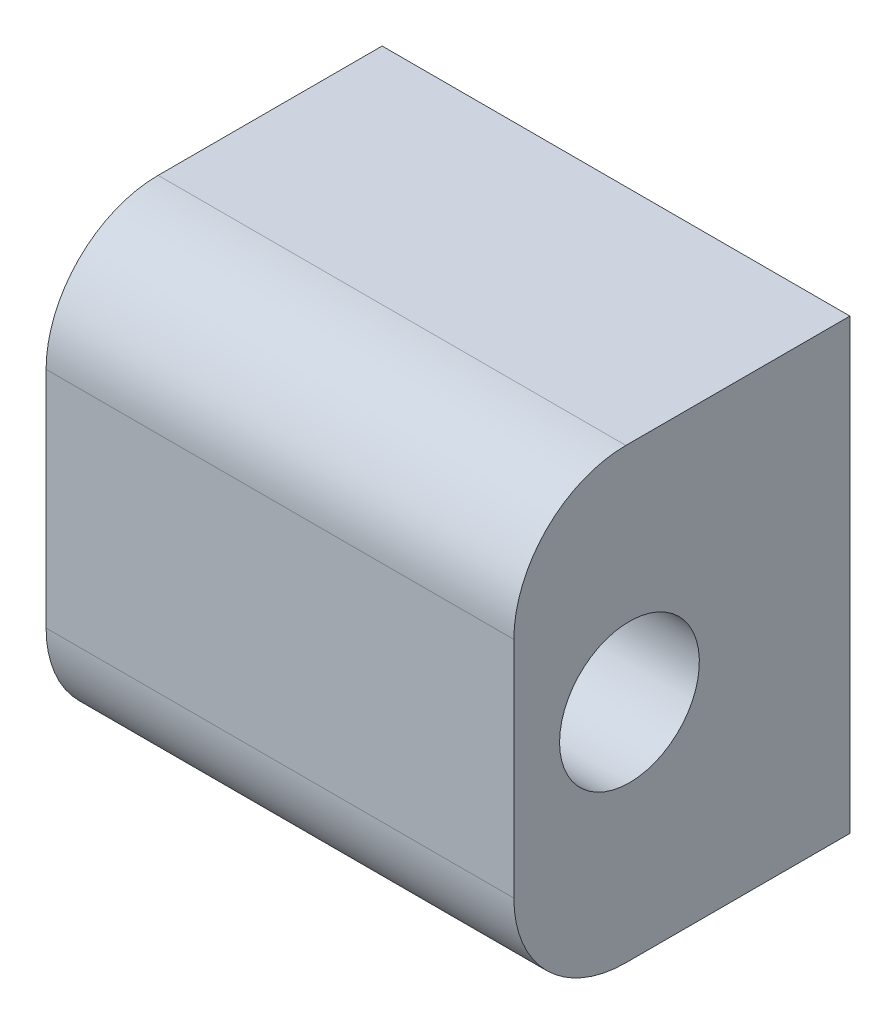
ISO-10303-21;
HEADER;
FILE_DESCRIPTION(('STEP AP214'),'2;1');
FILE_NAME('part.step','',(''),(''),'','','');
FILE_SCHEMA(('AUTOMOTIVE_DESIGN { 1 0 10303 214 1 1 1 1 }'));
ENDSEC;
DATA;
#1=APPLICATION_CONTEXT('core data for automotive mechanical design processes');
#2=APPLICATION_PROTOCOL_DEFINITION('international standard','automotive_design',2000,#1);
#3=PRODUCT_CONTEXT('',#1,'mechanical');
#4=PRODUCT('Part','Part','',(#3));
#5=PRODUCT_RELATED_PRODUCT_CATEGORY('part','',(#4));
#6=PRODUCT_DEFINITION_FORMATION('','',#4);
#7=PRODUCT_DEFINITION_CONTEXT('part definition',#1,'design');
#8=PRODUCT_DEFINITION('design','',#6,#7);
#9=PRODUCT_DEFINITION_SHAPE('','',#8);
#10=(LENGTH_UNIT() NAMED_UNIT(*) SI_UNIT(.MILLI.,.METRE.));
#11=(NAMED_UNIT(*) PLANE_ANGLE_UNIT() SI_UNIT($,.RADIAN.));
#12=(NAMED_UNIT(*) SI_UNIT($,.STERADIAN.) SOLID_ANGLE_UNIT());
#13=UNCERTAINTY_MEASURE_WITH_UNIT(LENGTH_MEASURE(1.E-05),#10,'distance_accuracy_value','');
#14=(GEOMETRIC_REPRESENTATION_CONTEXT(3) GLOBAL_UNCERTAINTY_ASSIGNED_CONTEXT((#13)) GLOBAL_UNIT_ASSIGNED_CONTEXT((#10,
#11,#12)) REPRESENTATION_CONTEXT('',''));
#15=CARTESIAN_POINT('',(0.,0.,0.));
#16=DIRECTION('',(0.,0.,1.));
#17=DIRECTION('',(1.,0.,0.));
#18=AXIS2_PLACEMENT_3D('',#15,#16,#17);
#19=CARTESIAN_POINT('',(0.,0.,0.));
#20=DIRECTION('',(0.,0.,1.));
#21=DIRECTION('',(1.,0.,0.));
#22=AXIS2_PLACEMENT_3D('',#19,#20,#21);
#23=PLANE('',#22);
#24=CARTESIAN_POINT('',(-7.1374,7.5438,0.));
#25=DIRECTION('',(0.,0.,1.));
#26=DIRECTION('',(1.,0.,0.));
#27=AXIS2_PLACEMENT_3D('',#24,#25,#26);
#28=CIRCLE('',#27,3.175);
#29=CARTESIAN_POINT('',(-3.9624,7.5438,0.));
#30=VERTEX_POINT('',#29);
#31=EDGE_CURVE('E233',#30,#30,#28,.T.);
#32=ORIENTED_EDGE('',*,*,#31,.T.);
#33=EDGE_LOOP('',(#32));
#34=FACE_BOUND('',#33,.T.);
#35=CARTESIAN_POINT('',(-7.1374,-7.5438,0.));
#36=DIRECTION('',(0.,0.,1.));
#37=DIRECTION('',(1.,0.,0.));
#38=AXIS2_PLACEMENT_3D('',#35,#36,#37);
#39=CIRCLE('',#38,3.175);
#40=CARTESIAN_POINT('',(-3.9624,-7.5438,0.));
#41=VERTEX_POINT('',#40);
#42=EDGE_CURVE('E227',#41,#41,#39,.T.);
#43=ORIENTED_EDGE('',*,*,#42,.T.);
#44=EDGE_LOOP('',(#43));
#45=FACE_BOUND('',#44,.T.);
#46=DIRECTION('',(1.,0.,0.));
#47=VECTOR('',#46,1.);
#48=CARTESIAN_POINT('',(-13.2588,-12.7,0.));
#49=LINE('',#48,#47);
#50=CARTESIAN_POINT('',(-13.2588,-12.7,0.));
#51=VERTEX_POINT('',#50);
#52=CARTESIAN_POINT('',(13.2588,-12.7,0.));
#53=VERTEX_POINT('',#52);
#54=EDGE_CURVE('E91',#51,#53,#49,.T.);
#55=ORIENTED_EDGE('',*,*,#54,.F.);
#56=DIRECTION('',(0.,-1.,0.));
#57=VECTOR('',#56,1.);
#58=CARTESIAN_POINT('',(-13.2588,12.7,0.));
#59=LINE('',#58,#57);
#60=CARTESIAN_POINT('',(-13.2588,12.7,0.));
#61=VERTEX_POINT('',#60);
#62=EDGE_CURVE('E100',#61,#51,#59,.T.);
#63=ORIENTED_EDGE('',*,*,#62,.F.);
#64=DIRECTION('',(-1.,0.,0.));
#65=VECTOR('',#64,1.);
#66=CARTESIAN_POINT('',(13.2588,12.7,0.));
#67=LINE('',#66,#65);
#68=CARTESIAN_POINT('',(13.2588,12.7,0.));
#69=VERTEX_POINT('',#68);
#70=EDGE_CURVE('E108',#69,#61,#67,.T.);
#71=ORIENTED_EDGE('',*,*,#70,.F.);
#72=DIRECTION('',(0.,1.,0.));
#73=VECTOR('',#72,1.);
#74=CARTESIAN_POINT('',(13.2588,0.,0.));
#75=LINE('',#74,#73);
#76=EDGE_CURVE('E113',#53,#69,#75,.T.);
#77=ORIENTED_EDGE('',*,*,#76,.F.);
#78=EDGE_LOOP('',(#55,#63,#71,#77));
#79=FACE_BOUND('',#78,.T.);
#80=CARTESIAN_POINT('',(7.1374,-7.5438,0.));
#81=DIRECTION('',(0.,0.,1.));
#82=DIRECTION('',(1.,0.,0.));
#83=AXIS2_PLACEMENT_3D('',#80,#81,#82);
#84=CIRCLE('',#83,3.175);
#85=CARTESIAN_POINT('',(10.3124,-7.5438,0.));
#86=VERTEX_POINT('',#85);
#87=EDGE_CURVE('E228',#86,#86,#84,.T.);
#88=ORIENTED_EDGE('',*,*,#87,.T.);
#89=EDGE_LOOP('',(#88));
#90=FACE_BOUND('',#89,.T.);
#91=CARTESIAN_POINT('',(7.1374,7.5438,0.));
#92=DIRECTION('',(0.,0.,1.));
#93=DIRECTION('',(1.,0.,0.));
#94=AXIS2_PLACEMENT_3D('',#91,#92,#93);
#95=CIRCLE('',#94,3.175);
#96=CARTESIAN_POINT('',(10.3124,7.5438,0.));
#97=VERTEX_POINT('',#96);
#98=EDGE_CURVE('E401',#97,#97,#95,.T.);
#99=ORIENTED_EDGE('',*,*,#98,.T.);
#100=EDGE_LOOP('',(#99));
#101=FACE_BOUND('',#100,.T.);
#102=ADVANCED_FACE('F33',(#34,#45,#79,#90,#101),#23,.F.);
#103=CARTESIAN_POINT('',(-13.2588,-12.7,19.05));
#104=DIRECTION('',(0.,1.,0.));
#105=DIRECTION('',(0.,0.,1.));
#106=AXIS2_PLACEMENT_3D('',#103,#104,#105);
#107=PLANE('',#106);
#108=DIRECTION('',(0.,0.,-1.));
#109=VECTOR('',#108,1.);
#110=CARTESIAN_POINT('',(13.2588,-12.7,19.05));
#111=LINE('',#110,#109);
#112=CARTESIAN_POINT('',(13.2588,-12.7,12.7));
#113=VERTEX_POINT('',#112);
#114=EDGE_CURVE('E97',#113,#53,#111,.T.);
#115=ORIENTED_EDGE('',*,*,#114,.F.);
#116=DIRECTION('',(1.,0.,0.));
#117=VECTOR('',#116,1.);
#118=CARTESIAN_POINT('',(-13.2588,-12.7,12.7));
#119=LINE('',#118,#117);
#120=CARTESIAN_POINT('',(-13.2588,-12.7,12.7));
#121=VERTEX_POINT('',#120);
#122=EDGE_CURVE('E93',#113,#121,#119,.F.);
#123=ORIENTED_EDGE('',*,*,#122,.T.);
#124=DIRECTION('',(0.,0.,-1.));
#125=VECTOR('',#124,1.);
#126=CARTESIAN_POINT('',(-13.2588,-12.7,19.05));
#127=LINE('',#126,#125);
#128=EDGE_CURVE('E87',#121,#51,#127,.T.);
#129=ORIENTED_EDGE('',*,*,#128,.T.);
#130=ORIENTED_EDGE('',*,*,#54,.T.);
#131=EDGE_LOOP('',(#115,#123,#129,#130));
#132=FACE_BOUND('',#131,.T.);
#133=ADVANCED_FACE('F89',(#132),#107,.F.);
#134=CARTESIAN_POINT('',(13.2588,0.,19.05));
#135=DIRECTION('',(-1.,0.,0.));
#136=DIRECTION('',(0.,0.,1.));
#137=AXIS2_PLACEMENT_3D('',#134,#135,#136);
#138=PLANE('',#137);
#139=CARTESIAN_POINT('',(13.2588,0.,12.4968));
#140=DIRECTION('',(-1.,0.,0.));
#141=DIRECTION('',(0.,0.,1.));
#142=AXIS2_PLACEMENT_3D('',#139,#140,#141);
#143=CIRCLE('',#142,3.9624);
#144=CARTESIAN_POINT('',(13.2588,0.,16.4592));
#145=VERTEX_POINT('',#144);
#146=EDGE_CURVE('E114',#145,#145,#143,.T.);
#147=ORIENTED_EDGE('',*,*,#146,.T.);
#148=EDGE_LOOP('',(#147));
#149=FACE_BOUND('',#148,.T.);
#150=DIRECTION('',(0.,0.,-1.));
#151=VECTOR('',#150,1.);
#152=CARTESIAN_POINT('',(13.2588,12.7,19.05));
#153=LINE('',#152,#151);
#154=CARTESIAN_POINT('',(13.2588,12.7,12.7));
#155=VERTEX_POINT('',#154);
#156=EDGE_CURVE('E126',#155,#69,#153,.T.);
#157=ORIENTED_EDGE('',*,*,#156,.F.);
#158=CARTESIAN_POINT('',(13.2588,6.35,12.7));
#159=DIRECTION('',(-1.,0.,0.));
#160=DIRECTION('',(0.,0.,1.));
#161=AXIS2_PLACEMENT_3D('',#158,#159,#160);
#162=CIRCLE('',#161,6.35);
#163=CARTESIAN_POINT('',(13.2588,6.35,19.05));
#164=VERTEX_POINT('',#163);
#165=EDGE_CURVE('E140',#155,#164,#162,.F.);
#166=ORIENTED_EDGE('',*,*,#165,.T.);
#167=DIRECTION('',(0.,1.,0.));
#168=VECTOR('',#167,1.);
#169=CARTESIAN_POINT('',(13.2588,-12.7,19.05));
#170=LINE('',#169,#168);
#171=CARTESIAN_POINT('',(13.2588,-6.35,19.05));
#172=VERTEX_POINT('',#171);
#173=EDGE_CURVE('E121',#172,#164,#170,.T.);
#174=ORIENTED_EDGE('',*,*,#173,.F.);
#175=CARTESIAN_POINT('',(13.2588,-6.35,12.7));
#176=DIRECTION('',(-1.,0.,0.));
#177=DIRECTION('',(0.,0.,1.));
#178=AXIS2_PLACEMENT_3D('',#175,#176,#177);
#179=CIRCLE('',#178,6.35);
#180=EDGE_CURVE('E48',#172,#113,#179,.F.);
#181=ORIENTED_EDGE('',*,*,#180,.T.);
#182=ORIENTED_EDGE('',*,*,#114,.T.);
#183=ORIENTED_EDGE('',*,*,#76,.T.);
#184=EDGE_LOOP('',(#157,#166,#174,#181,#182,#183));
#185=FACE_BOUND('',#184,.T.);
#186=ADVANCED_FACE('F181',(#149,#185),#138,.F.);
#187=CARTESIAN_POINT('',(13.2588,12.7,19.05));
#188=DIRECTION('',(0.,-1.,0.));
#189=DIRECTION('',(1.,0.,0.));
#190=AXIS2_PLACEMENT_3D('',#187,#188,#189);
#191=PLANE('',#190);
#192=DIRECTION('',(0.,0.,-1.));
#193=VECTOR('',#192,1.);
#194=CARTESIAN_POINT('',(-13.2588,12.7,19.05));
#195=LINE('',#194,#193);
#196=CARTESIAN_POINT('',(-13.2588,12.7,12.7));
#197=VERTEX_POINT('',#196);
#198=EDGE_CURVE('E103',#197,#61,#195,.T.);
#199=ORIENTED_EDGE('',*,*,#198,.F.);
#200=DIRECTION('',(-1.,0.,0.));
#201=VECTOR('',#200,1.);
#202=CARTESIAN_POINT('',(13.2588,12.7,12.7));
#203=LINE('',#202,#201);
#204=EDGE_CURVE('E56',#197,#155,#203,.F.);
#205=ORIENTED_EDGE('',*,*,#204,.T.);
#206=ORIENTED_EDGE('',*,*,#156,.T.);
#207=ORIENTED_EDGE('',*,*,#70,.T.);
#208=EDGE_LOOP('',(#199,#205,#206,#207));
#209=FACE_BOUND('',#208,.T.);
#210=ADVANCED_FACE('F191',(#209),#191,.F.);
#211=CARTESIAN_POINT('',(-13.2588,12.7,19.05));
#212=DIRECTION('',(1.,0.,0.));
#213=DIRECTION('',(0.,1.,0.));
#214=AXIS2_PLACEMENT_3D('',#211,#212,#213);
#215=PLANE('',#214);
#216=CARTESIAN_POINT('',(-13.2588,0.,12.4968));
#217=DIRECTION('',(-1.,0.,0.));
#218=DIRECTION('',(0.,-1.,0.));
#219=AXIS2_PLACEMENT_3D('',#216,#217,#218);
#220=CIRCLE('',#219,3.9624);
#221=CARTESIAN_POINT('',(-13.2588,-3.9624,12.4968));
#222=VERTEX_POINT('',#221);
#223=EDGE_CURVE('E118',#222,#222,#220,.T.);
#224=ORIENTED_EDGE('',*,*,#223,.F.);
#225=EDGE_LOOP('',(#224));
#226=FACE_BOUND('',#225,.T.);
#227=DIRECTION('',(0.,-1.,0.));
#228=VECTOR('',#227,1.);
#229=CARTESIAN_POINT('',(-13.2588,0.,19.05));
#230=LINE('',#229,#228);
#231=CARTESIAN_POINT('',(-13.2588,6.34999999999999,19.05));
#232=VERTEX_POINT('',#231);
#233=CARTESIAN_POINT('',(-13.2588,-6.35,19.05));
#234=VERTEX_POINT('',#233);
#235=EDGE_CURVE('E107',#232,#234,#230,.T.);
#236=ORIENTED_EDGE('',*,*,#235,.F.);
#237=CARTESIAN_POINT('',(-13.2588,6.34999999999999,12.7));
#238=DIRECTION('',(1.,0.,0.));
#239=DIRECTION('',(0.,1.,0.));
#240=AXIS2_PLACEMENT_3D('',#237,#238,#239);
#241=CIRCLE('',#240,6.35);
#242=EDGE_CURVE('E136',#232,#197,#241,.F.);
#243=ORIENTED_EDGE('',*,*,#242,.T.);
#244=ORIENTED_EDGE('',*,*,#198,.T.);
#245=ORIENTED_EDGE('',*,*,#62,.T.);
#246=ORIENTED_EDGE('',*,*,#128,.F.);
#247=CARTESIAN_POINT('',(-13.2588,-6.35,12.7));
#248=DIRECTION('',(1.,0.,0.));
#249=DIRECTION('',(0.,1.,0.));
#250=AXIS2_PLACEMENT_3D('',#247,#248,#249);
#251=CIRCLE('',#250,6.35);
#252=EDGE_CURVE('E134',#121,#234,#251,.F.);
#253=ORIENTED_EDGE('',*,*,#252,.T.);
#254=EDGE_LOOP('',(#236,#243,#244,#245,#246,#253));
#255=FACE_BOUND('',#254,.T.);
#256=ADVANCED_FACE('F102',(#226,#255),#215,.F.);
#257=CARTESIAN_POINT('',(0.,0.,19.05));
#258=DIRECTION('',(0.,0.,1.));
#259=DIRECTION('',(1.,0.,0.));
#260=AXIS2_PLACEMENT_3D('',#257,#258,#259);
#261=PLANE('',#260);
#262=ORIENTED_EDGE('',*,*,#173,.T.);
#263=DIRECTION('',(-1.,0.,0.));
#264=VECTOR('',#263,1.);
#265=CARTESIAN_POINT('',(-13.2588,6.34999999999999,19.05));
#266=LINE('',#265,#264);
#267=EDGE_CURVE('E131',#164,#232,#266,.T.);
#268=ORIENTED_EDGE('',*,*,#267,.T.);
#269=ORIENTED_EDGE('',*,*,#235,.T.);
#270=DIRECTION('',(1.,0.,0.));
#271=VECTOR('',#270,1.);
#272=CARTESIAN_POINT('',(13.2588,-6.35,19.05));
#273=LINE('',#272,#271);
#274=EDGE_CURVE('E96',#234,#172,#273,.T.);
#275=ORIENTED_EDGE('',*,*,#274,.T.);
#276=EDGE_LOOP('',(#262,#268,#269,#275));
#277=FACE_BOUND('',#276,.T.);
#278=ADVANCED_FACE('F187',(#277),#261,.T.);
#279=CARTESIAN_POINT('',(18.4912,0.,12.4968));
#280=DIRECTION('',(-1.,0.,0.));
#281=DIRECTION('',(0.,-1.,0.));
#282=AXIS2_PLACEMENT_3D('',#279,#280,#281);
#283=CYLINDRICAL_SURFACE('',#282,3.9624);
#284=ORIENTED_EDGE('',*,*,#223,.T.);
#285=EDGE_LOOP('',(#284));
#286=FACE_BOUND('',#285,.T.);
#287=ORIENTED_EDGE('',*,*,#146,.F.);
#288=EDGE_LOOP('',(#287));
#289=FACE_BOUND('',#288,.T.);
#290=ADVANCED_FACE('F223',(#286,#289),#283,.F.);
#291=CARTESIAN_POINT('',(-7.1374,-7.5438,17.272));
#292=DIRECTION('',(0.,0.,-1.));
#293=DIRECTION('',(-1.,0.,0.));
#294=AXIS2_PLACEMENT_3D('',#291,#292,#293);
#295=CYLINDRICAL_SURFACE('',#294,3.175);
#296=CARTESIAN_POINT('',(-7.1374,-7.5438,15.494));
#297=DIRECTION('',(0.,0.,1.));
#298=DIRECTION('',(1.,0.,0.));
#299=AXIS2_PLACEMENT_3D('',#296,#297,#298);
#300=CIRCLE('',#299,3.175);
#301=CARTESIAN_POINT('',(-10.3124,-7.5438,15.494));
#302=VERTEX_POINT('',#301);
#303=EDGE_CURVE('E149',#302,#302,#300,.T.);
#304=ORIENTED_EDGE('',*,*,#303,.T.);
#305=EDGE_LOOP('',(#304));
#306=FACE_BOUND('',#305,.T.);
#307=ORIENTED_EDGE('',*,*,#42,.F.);
#308=EDGE_LOOP('',(#307));
#309=FACE_BOUND('',#308,.T.);
#310=ADVANCED_FACE('F219',(#306,#309),#295,.F.);
#311=CARTESIAN_POINT('',(-7.1374,-7.5438,17.272));
#312=DIRECTION('',(0.,0.,1.));
#313=DIRECTION('',(1.,0.,0.));
#314=AXIS2_PLACEMENT_3D('',#311,#312,#313);
#315=PLANE('',#314);
#316=CARTESIAN_POINT('',(-7.1374,-7.5438,17.272));
#317=DIRECTION('',(0.,0.,1.));
#318=DIRECTION('',(1.,0.,0.));
#319=AXIS2_PLACEMENT_3D('',#316,#317,#318);
#320=CIRCLE('',#319,0.215911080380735);
#321=CARTESIAN_POINT('',(-7.35331108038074,-7.5438,17.272));
#322=VERTEX_POINT('',#321);
#323=EDGE_CURVE('E152',#322,#322,#320,.F.);
#324=ORIENTED_EDGE('',*,*,#323,.T.);
#325=EDGE_LOOP('',(#324));
#326=FACE_BOUND('',#325,.T.);
#327=ADVANCED_FACE('F222',(#326),#315,.F.);
#328=CARTESIAN_POINT('',(7.1374,-7.5438,17.272));
#329=DIRECTION('',(0.,0.,-1.));
#330=DIRECTION('',(-1.,0.,0.));
#331=AXIS2_PLACEMENT_3D('',#328,#329,#330);
#332=CYLINDRICAL_SURFACE('',#331,3.175);
#333=CARTESIAN_POINT('',(7.1374,-7.5438,15.494));
#334=DIRECTION('',(0.,0.,1.));
#335=DIRECTION('',(1.,0.,0.));
#336=AXIS2_PLACEMENT_3D('',#333,#334,#335);
#337=CIRCLE('',#336,3.175);
#338=CARTESIAN_POINT('',(3.9624,-7.5438,15.494));
#339=VERTEX_POINT('',#338);
#340=EDGE_CURVE('E143',#339,#339,#337,.T.);
#341=ORIENTED_EDGE('',*,*,#340,.T.);
#342=EDGE_LOOP('',(#341));
#343=FACE_BOUND('',#342,.T.);
#344=ORIENTED_EDGE('',*,*,#87,.F.);
#345=EDGE_LOOP('',(#344));
#346=FACE_BOUND('',#345,.T.);
#347=ADVANCED_FACE('F253',(#343,#346),#332,.F.);
#348=CARTESIAN_POINT('',(7.1374,-7.5438,17.272));
#349=DIRECTION('',(0.,0.,1.));
#350=DIRECTION('',(1.,0.,0.));
#351=AXIS2_PLACEMENT_3D('',#348,#349,#350);
#352=PLANE('',#351);
#353=CARTESIAN_POINT('',(7.1374,-7.5438,17.272));
#354=DIRECTION('',(0.,0.,1.));
#355=DIRECTION('',(1.,0.,0.));
#356=AXIS2_PLACEMENT_3D('',#353,#354,#355);
#357=CIRCLE('',#356,0.215911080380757);
#358=CARTESIAN_POINT('',(6.92148891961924,-7.5438,17.272));
#359=VERTEX_POINT('',#358);
#360=EDGE_CURVE('E146',#359,#359,#357,.F.);
#361=ORIENTED_EDGE('',*,*,#360,.T.);
#362=EDGE_LOOP('',(#361));
#363=FACE_BOUND('',#362,.T.);
#364=ADVANCED_FACE('F257',(#363),#352,.F.);
#365=CARTESIAN_POINT('',(-7.1374,7.5438,17.272));
#366=DIRECTION('',(0.,0.,-1.));
#367=DIRECTION('',(-1.,0.,0.));
#368=AXIS2_PLACEMENT_3D('',#365,#366,#367);
#369=CYLINDRICAL_SURFACE('',#368,3.175);
#370=CARTESIAN_POINT('',(-7.1374,7.5438,15.494));
#371=DIRECTION('',(0.,0.,1.));
#372=DIRECTION('',(1.,0.,0.));
#373=AXIS2_PLACEMENT_3D('',#370,#371,#372);
#374=CIRCLE('',#373,3.175);
#375=CARTESIAN_POINT('',(-10.3124,7.5438,15.494));
#376=VERTEX_POINT('',#375);
#377=EDGE_CURVE('E155',#376,#376,#374,.T.);
#378=ORIENTED_EDGE('',*,*,#377,.T.);
#379=EDGE_LOOP('',(#378));
#380=FACE_BOUND('',#379,.T.);
#381=ORIENTED_EDGE('',*,*,#31,.F.);
#382=EDGE_LOOP('',(#381));
#383=FACE_BOUND('',#382,.T.);
#384=ADVANCED_FACE('F261',(#380,#383),#369,.F.);
#385=CARTESIAN_POINT('',(-7.1374,7.5438,17.272));
#386=DIRECTION('',(0.,0.,1.));
#387=DIRECTION('',(1.,0.,0.));
#388=AXIS2_PLACEMENT_3D('',#385,#386,#387);
#389=PLANE('',#388);
#390=CARTESIAN_POINT('',(-7.1374,7.5438,17.272));
#391=DIRECTION('',(0.,0.,1.));
#392=DIRECTION('',(1.,0.,0.));
#393=AXIS2_PLACEMENT_3D('',#390,#391,#392);
#394=CIRCLE('',#393,0.215911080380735);
#395=CARTESIAN_POINT('',(-7.35331108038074,7.5438,17.272));
#396=VERTEX_POINT('',#395);
#397=EDGE_CURVE('E158',#396,#396,#394,.F.);
#398=ORIENTED_EDGE('',*,*,#397,.T.);
#399=EDGE_LOOP('',(#398));
#400=FACE_BOUND('',#399,.T.);
#401=ADVANCED_FACE('F265',(#400),#389,.F.);
#402=CARTESIAN_POINT('',(7.1374,7.5438,17.272));
#403=DIRECTION('',(0.,0.,-1.));
#404=DIRECTION('',(-1.,0.,0.));
#405=AXIS2_PLACEMENT_3D('',#402,#403,#404);
#406=CYLINDRICAL_SURFACE('',#405,3.175);
#407=CARTESIAN_POINT('',(7.1374,7.5438,15.494));
#408=DIRECTION('',(0.,0.,1.));
#409=DIRECTION('',(1.,0.,0.));
#410=AXIS2_PLACEMENT_3D('',#407,#408,#409);
#411=CIRCLE('',#410,3.175);
#412=CARTESIAN_POINT('',(3.9624,7.5438,15.494));
#413=VERTEX_POINT('',#412);
#414=EDGE_CURVE('E41',#413,#413,#411,.T.);
#415=ORIENTED_EDGE('',*,*,#414,.T.);
#416=EDGE_LOOP('',(#415));
#417=FACE_BOUND('',#416,.T.);
#418=ORIENTED_EDGE('',*,*,#98,.F.);
#419=EDGE_LOOP('',(#418));
#420=FACE_BOUND('',#419,.T.);
#421=ADVANCED_FACE('F163',(#417,#420),#406,.F.);
#422=CARTESIAN_POINT('',(7.1374,7.5438,17.272));
#423=DIRECTION('',(0.,0.,1.));
#424=DIRECTION('',(1.,0.,0.));
#425=AXIS2_PLACEMENT_3D('',#422,#423,#424);
#426=PLANE('',#425);
#427=CARTESIAN_POINT('',(7.1374,7.5438,17.272));
#428=DIRECTION('',(0.,0.,1.));
#429=DIRECTION('',(1.,0.,0.));
#430=AXIS2_PLACEMENT_3D('',#427,#428,#429);
#431=CIRCLE('',#430,0.215911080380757);
#432=CARTESIAN_POINT('',(6.92148891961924,7.5438,17.272));
#433=VERTEX_POINT('',#432);
#434=EDGE_CURVE('E11',#433,#433,#431,.F.);
#435=ORIENTED_EDGE('',*,*,#434,.T.);
#436=EDGE_LOOP('',(#435));
#437=FACE_BOUND('',#436,.T.);
#438=ADVANCED_FACE('F202',(#437),#426,.F.);
#439=CARTESIAN_POINT('',(0.,6.35,12.7));
#440=DIRECTION('',(1.,0.,0.));
#441=DIRECTION('',(0.,1.,0.));
#442=AXIS2_PLACEMENT_3D('',#439,#440,#441);
#443=CYLINDRICAL_SURFACE('',#442,6.35);
#444=ORIENTED_EDGE('',*,*,#165,.F.);
#445=ORIENTED_EDGE('',*,*,#204,.F.);
#446=ORIENTED_EDGE('',*,*,#242,.F.);
#447=ORIENTED_EDGE('',*,*,#267,.F.);
#448=EDGE_LOOP('',(#444,#445,#446,#447));
#449=FACE_BOUND('',#448,.T.);
#450=ADVANCED_FACE('F198',(#449),#443,.T.);
#451=CARTESIAN_POINT('',(0.,-6.35,12.7));
#452=DIRECTION('',(-1.,0.,0.));
#453=DIRECTION('',(0.,0.,1.));
#454=AXIS2_PLACEMENT_3D('',#451,#452,#453);
#455=CYLINDRICAL_SURFACE('',#454,6.35);
#456=ORIENTED_EDGE('',*,*,#252,.F.);
#457=ORIENTED_EDGE('',*,*,#122,.F.);
#458=ORIENTED_EDGE('',*,*,#180,.F.);
#459=ORIENTED_EDGE('',*,*,#274,.F.);
#460=EDGE_LOOP('',(#456,#457,#458,#459));
#461=FACE_BOUND('',#460,.T.);
#462=ADVANCED_FACE('F201',(#461),#455,.T.);
#463=CARTESIAN_POINT('',(7.1374,-7.5438,15.494));
#464=DIRECTION('',(0.,0.,-1.));
#465=DIRECTION('',(-1.,0.,0.));
#466=AXIS2_PLACEMENT_3D('',#463,#464,#465);
#467=CONICAL_SURFACE('',#466,3.175,1.02974425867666);
#468=CARTESIAN_POINT('',(6.92148891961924,-7.5438,17.272));
#469=CARTESIAN_POINT('',(6.89066507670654,-7.5438,17.2534791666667));
#470=CARTESIAN_POINT('',(6.85984123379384,-7.5438,17.2349583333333));
#471=CARTESIAN_POINT('',(6.79819354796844,-7.5438,17.1979166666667));
#472=CARTESIAN_POINT('',(6.76736970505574,-7.5438,17.1793958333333));
#473=CARTESIAN_POINT('',(6.70572201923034,-7.5438,17.1423541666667));
#474=CARTESIAN_POINT('',(6.67489817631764,-7.5438,17.1238333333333));
#475=CARTESIAN_POINT('',(6.61325049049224,-7.5438,17.0867916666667));
#476=CARTESIAN_POINT('',(6.58242664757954,-7.5438,17.0682708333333));
#477=CARTESIAN_POINT('',(6.52077896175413,-7.5438,17.0312291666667));
#478=CARTESIAN_POINT('',(6.48995511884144,-7.5438,17.0127083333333));
#479=CARTESIAN_POINT('',(6.42830743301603,-7.5438,16.9756666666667));
#480=CARTESIAN_POINT('',(6.39748359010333,-7.5438,16.9571458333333));
#481=CARTESIAN_POINT('',(6.33583590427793,-7.5438,16.9201041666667));
#482=CARTESIAN_POINT('',(6.30501206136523,-7.5438,16.9015833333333));
#483=CARTESIAN_POINT('',(6.24336437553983,-7.5438,16.8645416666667));
#484=CARTESIAN_POINT('',(6.21254053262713,-7.5438,16.8460208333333));
#485=CARTESIAN_POINT('',(6.15089284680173,-7.5438,16.8089791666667));
#486=CARTESIAN_POINT('',(6.12006900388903,-7.5438,16.7904583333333));
#487=CARTESIAN_POINT('',(6.05842131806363,-7.5438,16.7534166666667));
#488=CARTESIAN_POINT('',(6.02759747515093,-7.5438,16.7348958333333));
#489=CARTESIAN_POINT('',(5.96594978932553,-7.5438,16.6978541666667));
#490=CARTESIAN_POINT('',(5.93512594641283,-7.5438,16.6793333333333));
#491=CARTESIAN_POINT('',(5.87347826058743,-7.5438,16.6422916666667));
#492=CARTESIAN_POINT('',(5.84265441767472,-7.5438,16.6237708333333));
#493=CARTESIAN_POINT('',(5.78100673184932,-7.5438,16.5867291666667));
#494=CARTESIAN_POINT('',(5.75018288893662,-7.5438,16.5682083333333));
#495=CARTESIAN_POINT('',(5.68853520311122,-7.5438,16.5311666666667));
#496=CARTESIAN_POINT('',(5.65771136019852,-7.5438,16.5126458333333));
#497=CARTESIAN_POINT('',(5.59606367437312,-7.5438,16.4756041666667));
#498=CARTESIAN_POINT('',(5.56523983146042,-7.5438,16.4570833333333));
#499=CARTESIAN_POINT('',(5.50359214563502,-7.5438,16.4200416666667));
#500=CARTESIAN_POINT('',(5.47276830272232,-7.5438,16.4015208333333));
#501=CARTESIAN_POINT('',(5.41112061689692,-7.5438,16.3644791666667));
#502=CARTESIAN_POINT('',(5.38029677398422,-7.5438,16.3459583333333));
#503=CARTESIAN_POINT('',(5.31864908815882,-7.5438,16.3089166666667));
#504=CARTESIAN_POINT('',(5.28782524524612,-7.5438,16.2903958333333));
#505=CARTESIAN_POINT('',(5.22617755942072,-7.5438,16.2533541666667));
#506=CARTESIAN_POINT('',(5.19535371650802,-7.5438,16.2348333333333));
#507=CARTESIAN_POINT('',(5.13370603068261,-7.5438,16.1977916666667));
#508=CARTESIAN_POINT('',(5.10288218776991,-7.5438,16.1792708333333));
#509=CARTESIAN_POINT('',(5.04123450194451,-7.5438,16.1422291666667));
#510=CARTESIAN_POINT('',(5.01041065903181,-7.5438,16.1237083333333));
#511=CARTESIAN_POINT('',(4.94876297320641,-7.5438,16.0866666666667));
#512=CARTESIAN_POINT('',(4.91793913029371,-7.5438,16.0681458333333));
#513=CARTESIAN_POINT('',(4.85629144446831,-7.5438,16.0311041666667));
#514=CARTESIAN_POINT('',(4.82546760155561,-7.5438,16.0125833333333));
#515=CARTESIAN_POINT('',(4.76381991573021,-7.5438,15.9755416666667));
#516=CARTESIAN_POINT('',(4.73299607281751,-7.5438,15.9570208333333));
#517=CARTESIAN_POINT('',(4.67134838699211,-7.5438,15.9199791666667));
#518=CARTESIAN_POINT('',(4.64052454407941,-7.5438,15.9014583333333));
#519=CARTESIAN_POINT('',(4.57887685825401,-7.5438,15.8644166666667));
#520=CARTESIAN_POINT('',(4.54805301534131,-7.5438,15.8458958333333));
#521=CARTESIAN_POINT('',(4.4864053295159,-7.5438,15.8088541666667));
#522=CARTESIAN_POINT('',(4.45558148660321,-7.5438,15.7903333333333));
#523=CARTESIAN_POINT('',(4.39393380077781,-7.5438,15.7532916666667));
#524=CARTESIAN_POINT('',(4.3631099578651,-7.5438,15.7347708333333));
#525=CARTESIAN_POINT('',(4.3014622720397,-7.5438,15.6977291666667));
#526=CARTESIAN_POINT('',(4.270638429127,-7.5438,15.6792083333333));
#527=CARTESIAN_POINT('',(4.2089907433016,-7.5438,15.6421666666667));
#528=CARTESIAN_POINT('',(4.1781669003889,-7.5438,15.6236458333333));
#529=CARTESIAN_POINT('',(4.1165192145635,-7.5438,15.5866041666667));
#530=CARTESIAN_POINT('',(4.0856953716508,-7.5438,15.5680833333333));
#531=CARTESIAN_POINT('',(4.0240476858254,-7.5438,15.5310416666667));
#532=CARTESIAN_POINT('',(3.9932238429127,-7.5438,15.5125208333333));
#533=CARTESIAN_POINT('',(3.9624,-7.5438,15.494));
#534=B_SPLINE_CURVE_WITH_KNOTS('',3,(#468,#469,#470,#471,#472,#473,#474,#475,#476,#477,#478,
#479,#480,#481,#482,#483,#484,#485,#486,#487,#488,#489,#490,#491,#492,#493,#494,#495,#496,#497,
#498,#499,#500,#501,#502,#503,#504,#505,#506,#507,#508,#509,#510,#511,#512,#513,#514,#515,#516,
#517,#518,#519,#520,#521,#522,#523,#524,#525,#526,#527,#528,#529,#530,#531,#532,#533),
.UNSPECIFIED.,.F.,.F.,(4,2,2,2,2,2,2,2,2,2,2,2,2,2,2,2,2,2,2,2,2,2,2,2,2,2,2,2,2,2,2,2,4),(0.,
0.107880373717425,0.21576074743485,0.323641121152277,0.431521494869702,0.539401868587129,
0.647282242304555,0.755162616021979,0.863042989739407,0.970923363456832,1.07880373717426,
1.18668411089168,1.29456448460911,1.40244485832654,1.51032523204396,1.61820560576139,
1.72608597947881,1.83396635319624,1.94184672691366,2.04972710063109,2.15760747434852,
2.26548784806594,2.37336822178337,2.48124859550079,2.58912896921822,2.69700934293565,
2.80488971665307,2.9127700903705,3.02065046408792,3.12853083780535,3.23641121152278,
3.3442915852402,3.45217195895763),.UNSPECIFIED.);
#535=EDGE_CURVE('BSEAM206',#359,#339,#534,.T.);
#536=ORIENTED_EDGE('',*,*,#360,.F.);
#537=ORIENTED_EDGE('',*,*,#340,.F.);
#538=ORIENTED_EDGE('',*,*,#535,.T.);
#539=ORIENTED_EDGE('',*,*,#535,.F.);
#540=EDGE_LOOP('',(#536,#538,#537,#539));
#541=FACE_BOUND('',#540,.T.);
#542=ADVANCED_FACE('F206',(#541),#467,.F.);
#543=CARTESIAN_POINT('',(-7.1374,-7.5438,15.494));
#544=DIRECTION('',(0.,0.,-1.));
#545=DIRECTION('',(-1.,0.,0.));
#546=AXIS2_PLACEMENT_3D('',#543,#544,#545);
#547=CONICAL_SURFACE('',#546,3.175,1.02974425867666);
#548=CARTESIAN_POINT('',(-7.35331108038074,-7.5438,17.272));
#549=CARTESIAN_POINT('',(-7.38413492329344,-7.5438,17.2534791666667));
#550=CARTESIAN_POINT('',(-7.41495876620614,-7.5438,17.2349583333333));
#551=CARTESIAN_POINT('',(-7.47660645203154,-7.5438,17.1979166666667));
#552=CARTESIAN_POINT('',(-7.50743029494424,-7.5438,17.1793958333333));
#553=CARTESIAN_POINT('',(-7.56907798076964,-7.5438,17.1423541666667));
#554=CARTESIAN_POINT('',(-7.59990182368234,-7.5438,17.1238333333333));
#555=CARTESIAN_POINT('',(-7.66154950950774,-7.5438,17.0867916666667));
#556=CARTESIAN_POINT('',(-7.69237335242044,-7.5438,17.0682708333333));
#557=CARTESIAN_POINT('',(-7.75402103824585,-7.5438,17.0312291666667));
#558=CARTESIAN_POINT('',(-7.78484488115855,-7.5438,17.0127083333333));
#559=CARTESIAN_POINT('',(-7.84649256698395,-7.5438,16.9756666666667));
#560=CARTESIAN_POINT('',(-7.87731640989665,-7.5438,16.9571458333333));
#561=CARTESIAN_POINT('',(-7.93896409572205,-7.5438,16.9201041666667));
#562=CARTESIAN_POINT('',(-7.96978793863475,-7.5438,16.9015833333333));
#563=CARTESIAN_POINT('',(-8.03143562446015,-7.5438,16.8645416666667));
#564=CARTESIAN_POINT('',(-8.06225946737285,-7.5438,16.8460208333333));
#565=CARTESIAN_POINT('',(-8.12390715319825,-7.5438,16.8089791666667));
#566=CARTESIAN_POINT('',(-8.15473099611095,-7.5438,16.7904583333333));
#567=CARTESIAN_POINT('',(-8.21637868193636,-7.5438,16.7534166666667));
#568=CARTESIAN_POINT('',(-8.24720252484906,-7.5438,16.7348958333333));
#569=CARTESIAN_POINT('',(-8.30885021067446,-7.5438,16.6978541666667));
#570=CARTESIAN_POINT('',(-8.33967405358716,-7.5438,16.6793333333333));
#571=CARTESIAN_POINT('',(-8.40132173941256,-7.5438,16.6422916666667));
#572=CARTESIAN_POINT('',(-8.43214558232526,-7.5438,16.6237708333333));
#573=CARTESIAN_POINT('',(-8.49379326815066,-7.5438,16.5867291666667));
#574=CARTESIAN_POINT('',(-8.52461711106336,-7.5438,16.5682083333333));
#575=CARTESIAN_POINT('',(-8.58626479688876,-7.5438,16.5311666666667));
#576=CARTESIAN_POINT('',(-8.61708863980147,-7.5438,16.5126458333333));
#577=CARTESIAN_POINT('',(-8.67873632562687,-7.5438,16.4756041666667));
#578=CARTESIAN_POINT('',(-8.70956016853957,-7.5438,16.4570833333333));
#579=CARTESIAN_POINT('',(-8.77120785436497,-7.5438,16.4200416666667));
#580=CARTESIAN_POINT('',(-8.80203169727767,-7.5438,16.4015208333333));
#581=CARTESIAN_POINT('',(-8.86367938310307,-7.5438,16.3644791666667));
#582=CARTESIAN_POINT('',(-8.89450322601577,-7.5438,16.3459583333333));
#583=CARTESIAN_POINT('',(-8.95615091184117,-7.5438,16.3089166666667));
#584=CARTESIAN_POINT('',(-8.98697475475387,-7.5438,16.2903958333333));
#585=CARTESIAN_POINT('',(-9.04862244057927,-7.5438,16.2533541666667));
#586=CARTESIAN_POINT('',(-9.07944628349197,-7.5438,16.2348333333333));
#587=CARTESIAN_POINT('',(-9.14109396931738,-7.5438,16.1977916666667));
#588=CARTESIAN_POINT('',(-9.17191781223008,-7.5438,16.1792708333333));
#589=CARTESIAN_POINT('',(-9.23356549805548,-7.5438,16.1422291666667));
#590=CARTESIAN_POINT('',(-9.26438934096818,-7.5438,16.1237083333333));
#591=CARTESIAN_POINT('',(-9.32603702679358,-7.5438,16.0866666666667));
#592=CARTESIAN_POINT('',(-9.35686086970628,-7.5438,16.0681458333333));
#593=CARTESIAN_POINT('',(-9.41850855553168,-7.5438,16.0311041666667));
#594=CARTESIAN_POINT('',(-9.44933239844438,-7.5438,16.0125833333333));
#595=CARTESIAN_POINT('',(-9.51098008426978,-7.5438,15.9755416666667));
#596=CARTESIAN_POINT('',(-9.54180392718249,-7.5438,15.9570208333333));
#597=CARTESIAN_POINT('',(-9.60345161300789,-7.5438,15.9199791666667));
#598=CARTESIAN_POINT('',(-9.63427545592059,-7.5438,15.9014583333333));
#599=CARTESIAN_POINT('',(-9.69592314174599,-7.5438,15.8644166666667));
#600=CARTESIAN_POINT('',(-9.72674698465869,-7.5438,15.8458958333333));
#601=CARTESIAN_POINT('',(-9.78839467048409,-7.5438,15.8088541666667));
#602=CARTESIAN_POINT('',(-9.81921851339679,-7.5438,15.7903333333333));
#603=CARTESIAN_POINT('',(-9.88086619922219,-7.5438,15.7532916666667));
#604=CARTESIAN_POINT('',(-9.91169004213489,-7.5438,15.7347708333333));
#605=CARTESIAN_POINT('',(-9.9733377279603,-7.5438,15.6977291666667));
#606=CARTESIAN_POINT('',(-10.004161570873,-7.5438,15.6792083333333));
#607=CARTESIAN_POINT('',(-10.0658092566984,-7.5438,15.6421666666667));
#608=CARTESIAN_POINT('',(-10.0966330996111,-7.5438,15.6236458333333));
#609=CARTESIAN_POINT('',(-10.1582807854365,-7.5438,15.5866041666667));
#610=CARTESIAN_POINT('',(-10.1891046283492,-7.5438,15.5680833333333));
#611=CARTESIAN_POINT('',(-10.2507523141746,-7.5438,15.5310416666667));
#612=CARTESIAN_POINT('',(-10.2815761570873,-7.5438,15.5125208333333));
#613=CARTESIAN_POINT('',(-10.3124,-7.5438,15.494));
#614=B_SPLINE_CURVE_WITH_KNOTS('',3,(#548,#549,#550,#551,#552,#553,#554,#555,#556,#557,#558,
#559,#560,#561,#562,#563,#564,#565,#566,#567,#568,#569,#570,#571,#572,#573,#574,#575,#576,#577,
#578,#579,#580,#581,#582,#583,#584,#585,#586,#587,#588,#589,#590,#591,#592,#593,#594,#595,#596,
#597,#598,#599,#600,#601,#602,#603,#604,#605,#606,#607,#608,#609,#610,#611,#612,#613),
.UNSPECIFIED.,.F.,.F.,(4,2,2,2,2,2,2,2,2,2,2,2,2,2,2,2,2,2,2,2,2,2,2,2,2,2,2,2,2,2,2,2,4),(0.,
0.107880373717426,0.215760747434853,0.323641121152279,0.431521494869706,0.539401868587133,
0.647282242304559,0.755162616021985,0.863042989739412,0.970923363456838,1.07880373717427,
1.18668411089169,1.29456448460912,1.40244485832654,1.51032523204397,1.6182056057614,
1.72608597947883,1.83396635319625,1.94184672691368,2.0497271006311,2.15760747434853,
2.26548784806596,2.37336822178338,2.48124859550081,2.58912896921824,2.69700934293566,
2.80488971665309,2.91277009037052,3.02065046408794,3.12853083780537,3.2364112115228,
3.34429158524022,3.45217195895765),.UNSPECIFIED.);
#615=EDGE_CURVE('BSEAM172',#322,#302,#614,.T.);
#616=ORIENTED_EDGE('',*,*,#323,.F.);
#617=ORIENTED_EDGE('',*,*,#303,.F.);
#618=ORIENTED_EDGE('',*,*,#615,.T.);
#619=ORIENTED_EDGE('',*,*,#615,.F.);
#620=EDGE_LOOP('',(#616,#618,#617,#619));
#621=FACE_BOUND('',#620,.T.);
#622=ADVANCED_FACE('F172',(#621),#547,.F.);
#623=CARTESIAN_POINT('',(-7.1374,7.5438,15.494));
#624=DIRECTION('',(0.,0.,-1.));
#625=DIRECTION('',(-1.,0.,0.));
#626=AXIS2_PLACEMENT_3D('',#623,#624,#625);
#627=CONICAL_SURFACE('',#626,3.175,1.02974425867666);
#628=CARTESIAN_POINT('',(-7.35331108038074,7.5438,17.272));
#629=CARTESIAN_POINT('',(-7.38413492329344,7.5438,17.2534791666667));
#630=CARTESIAN_POINT('',(-7.41495876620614,7.5438,17.2349583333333));
#631=CARTESIAN_POINT('',(-7.47660645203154,7.5438,17.1979166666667));
#632=CARTESIAN_POINT('',(-7.50743029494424,7.5438,17.1793958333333));
#633=CARTESIAN_POINT('',(-7.56907798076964,7.5438,17.1423541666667));
#634=CARTESIAN_POINT('',(-7.59990182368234,7.5438,17.1238333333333));
#635=CARTESIAN_POINT('',(-7.66154950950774,7.5438,17.0867916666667));
#636=CARTESIAN_POINT('',(-7.69237335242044,7.5438,17.0682708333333));
#637=CARTESIAN_POINT('',(-7.75402103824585,7.5438,17.0312291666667));
#638=CARTESIAN_POINT('',(-7.78484488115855,7.5438,17.0127083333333));
#639=CARTESIAN_POINT('',(-7.84649256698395,7.5438,16.9756666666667));
#640=CARTESIAN_POINT('',(-7.87731640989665,7.5438,16.9571458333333));
#641=CARTESIAN_POINT('',(-7.93896409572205,7.5438,16.9201041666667));
#642=CARTESIAN_POINT('',(-7.96978793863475,7.5438,16.9015833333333));
#643=CARTESIAN_POINT('',(-8.03143562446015,7.5438,16.8645416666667));
#644=CARTESIAN_POINT('',(-8.06225946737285,7.5438,16.8460208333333));
#645=CARTESIAN_POINT('',(-8.12390715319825,7.5438,16.8089791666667));
#646=CARTESIAN_POINT('',(-8.15473099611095,7.5438,16.7904583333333));
#647=CARTESIAN_POINT('',(-8.21637868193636,7.5438,16.7534166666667));
#648=CARTESIAN_POINT('',(-8.24720252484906,7.5438,16.7348958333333));
#649=CARTESIAN_POINT('',(-8.30885021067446,7.5438,16.6978541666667));
#650=CARTESIAN_POINT('',(-8.33967405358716,7.5438,16.6793333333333));
#651=CARTESIAN_POINT('',(-8.40132173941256,7.5438,16.6422916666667));
#652=CARTESIAN_POINT('',(-8.43214558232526,7.5438,16.6237708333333));
#653=CARTESIAN_POINT('',(-8.49379326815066,7.5438,16.5867291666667));
#654=CARTESIAN_POINT('',(-8.52461711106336,7.5438,16.5682083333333));
#655=CARTESIAN_POINT('',(-8.58626479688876,7.5438,16.5311666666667));
#656=CARTESIAN_POINT('',(-8.61708863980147,7.5438,16.5126458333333));
#657=CARTESIAN_POINT('',(-8.67873632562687,7.5438,16.4756041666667));
#658=CARTESIAN_POINT('',(-8.70956016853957,7.5438,16.4570833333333));
#659=CARTESIAN_POINT('',(-8.77120785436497,7.5438,16.4200416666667));
#660=CARTESIAN_POINT('',(-8.80203169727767,7.5438,16.4015208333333));
#661=CARTESIAN_POINT('',(-8.86367938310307,7.5438,16.3644791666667));
#662=CARTESIAN_POINT('',(-8.89450322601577,7.5438,16.3459583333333));
#663=CARTESIAN_POINT('',(-8.95615091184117,7.5438,16.3089166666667));
#664=CARTESIAN_POINT('',(-8.98697475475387,7.5438,16.2903958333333));
#665=CARTESIAN_POINT('',(-9.04862244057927,7.5438,16.2533541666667));
#666=CARTESIAN_POINT('',(-9.07944628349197,7.5438,16.2348333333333));
#667=CARTESIAN_POINT('',(-9.14109396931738,7.5438,16.1977916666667));
#668=CARTESIAN_POINT('',(-9.17191781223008,7.5438,16.1792708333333));
#669=CARTESIAN_POINT('',(-9.23356549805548,7.5438,16.1422291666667));
#670=CARTESIAN_POINT('',(-9.26438934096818,7.5438,16.1237083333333));
#671=CARTESIAN_POINT('',(-9.32603702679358,7.5438,16.0866666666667));
#672=CARTESIAN_POINT('',(-9.35686086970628,7.5438,16.0681458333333));
#673=CARTESIAN_POINT('',(-9.41850855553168,7.5438,16.0311041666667));
#674=CARTESIAN_POINT('',(-9.44933239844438,7.5438,16.0125833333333));
#675=CARTESIAN_POINT('',(-9.51098008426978,7.5438,15.9755416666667));
#676=CARTESIAN_POINT('',(-9.54180392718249,7.5438,15.9570208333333));
#677=CARTESIAN_POINT('',(-9.60345161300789,7.5438,15.9199791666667));
#678=CARTESIAN_POINT('',(-9.63427545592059,7.5438,15.9014583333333));
#679=CARTESIAN_POINT('',(-9.69592314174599,7.5438,15.8644166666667));
#680=CARTESIAN_POINT('',(-9.72674698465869,7.5438,15.8458958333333));
#681=CARTESIAN_POINT('',(-9.78839467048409,7.5438,15.8088541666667));
#682=CARTESIAN_POINT('',(-9.81921851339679,7.5438,15.7903333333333));
#683=CARTESIAN_POINT('',(-9.88086619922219,7.5438,15.7532916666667));
#684=CARTESIAN_POINT('',(-9.91169004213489,7.5438,15.7347708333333));
#685=CARTESIAN_POINT('',(-9.9733377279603,7.5438,15.6977291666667));
#686=CARTESIAN_POINT('',(-10.004161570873,7.5438,15.6792083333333));
#687=CARTESIAN_POINT('',(-10.0658092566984,7.5438,15.6421666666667));
#688=CARTESIAN_POINT('',(-10.0966330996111,7.5438,15.6236458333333));
#689=CARTESIAN_POINT('',(-10.1582807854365,7.5438,15.5866041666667));
#690=CARTESIAN_POINT('',(-10.1891046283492,7.5438,15.5680833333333));
#691=CARTESIAN_POINT('',(-10.2507523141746,7.5438,15.5310416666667));
#692=CARTESIAN_POINT('',(-10.2815761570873,7.5438,15.5125208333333));
#693=CARTESIAN_POINT('',(-10.3124,7.5438,15.494));
#694=B_SPLINE_CURVE_WITH_KNOTS('',3,(#628,#629,#630,#631,#632,#633,#634,#635,#636,#637,#638,
#639,#640,#641,#642,#643,#644,#645,#646,#647,#648,#649,#650,#651,#652,#653,#654,#655,#656,#657,
#658,#659,#660,#661,#662,#663,#664,#665,#666,#667,#668,#669,#670,#671,#672,#673,#674,#675,#676,
#677,#678,#679,#680,#681,#682,#683,#684,#685,#686,#687,#688,#689,#690,#691,#692,#693),
.UNSPECIFIED.,.F.,.F.,(4,2,2,2,2,2,2,2,2,2,2,2,2,2,2,2,2,2,2,2,2,2,2,2,2,2,2,2,2,2,2,2,4),(0.,
0.107880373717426,0.215760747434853,0.323641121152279,0.431521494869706,0.539401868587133,
0.647282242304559,0.755162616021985,0.863042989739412,0.970923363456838,1.07880373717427,
1.18668411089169,1.29456448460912,1.40244485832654,1.51032523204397,1.6182056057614,
1.72608597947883,1.83396635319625,1.94184672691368,2.0497271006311,2.15760747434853,
2.26548784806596,2.37336822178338,2.48124859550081,2.58912896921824,2.69700934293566,
2.80488971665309,2.91277009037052,3.02065046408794,3.12853083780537,3.2364112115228,
3.34429158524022,3.45217195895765),.UNSPECIFIED.);
#695=EDGE_CURVE('BSEAM167',#396,#376,#694,.T.);
#696=ORIENTED_EDGE('',*,*,#397,.F.);
#697=ORIENTED_EDGE('',*,*,#377,.F.);
#698=ORIENTED_EDGE('',*,*,#695,.T.);
#699=ORIENTED_EDGE('',*,*,#695,.F.);
#700=EDGE_LOOP('',(#696,#698,#697,#699));
#701=FACE_BOUND('',#700,.T.);
#702=ADVANCED_FACE('F167',(#701),#627,.F.);
#703=CARTESIAN_POINT('',(7.1374,7.5438,15.494));
#704=DIRECTION('',(0.,0.,-1.));
#705=DIRECTION('',(-1.,0.,0.));
#706=AXIS2_PLACEMENT_3D('',#703,#704,#705);
#707=CONICAL_SURFACE('',#706,3.175,1.02974425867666);
#708=CARTESIAN_POINT('',(6.92148891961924,7.5438,17.272));
#709=CARTESIAN_POINT('',(6.89066507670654,7.5438,17.2534791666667));
#710=CARTESIAN_POINT('',(6.85984123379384,7.5438,17.2349583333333));
#711=CARTESIAN_POINT('',(6.79819354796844,7.5438,17.1979166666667));
#712=CARTESIAN_POINT('',(6.76736970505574,7.5438,17.1793958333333));
#713=CARTESIAN_POINT('',(6.70572201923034,7.5438,17.1423541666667));
#714=CARTESIAN_POINT('',(6.67489817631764,7.5438,17.1238333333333));
#715=CARTESIAN_POINT('',(6.61325049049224,7.5438,17.0867916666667));
#716=CARTESIAN_POINT('',(6.58242664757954,7.5438,17.0682708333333));
#717=CARTESIAN_POINT('',(6.52077896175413,7.5438,17.0312291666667));
#718=CARTESIAN_POINT('',(6.48995511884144,7.5438,17.0127083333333));
#719=CARTESIAN_POINT('',(6.42830743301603,7.5438,16.9756666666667));
#720=CARTESIAN_POINT('',(6.39748359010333,7.5438,16.9571458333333));
#721=CARTESIAN_POINT('',(6.33583590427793,7.5438,16.9201041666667));
#722=CARTESIAN_POINT('',(6.30501206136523,7.5438,16.9015833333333));
#723=CARTESIAN_POINT('',(6.24336437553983,7.5438,16.8645416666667));
#724=CARTESIAN_POINT('',(6.21254053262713,7.5438,16.8460208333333));
#725=CARTESIAN_POINT('',(6.15089284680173,7.5438,16.8089791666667));
#726=CARTESIAN_POINT('',(6.12006900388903,7.5438,16.7904583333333));
#727=CARTESIAN_POINT('',(6.05842131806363,7.5438,16.7534166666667));
#728=CARTESIAN_POINT('',(6.02759747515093,7.5438,16.7348958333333));
#729=CARTESIAN_POINT('',(5.96594978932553,7.5438,16.6978541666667));
#730=CARTESIAN_POINT('',(5.93512594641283,7.5438,16.6793333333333));
#731=CARTESIAN_POINT('',(5.87347826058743,7.5438,16.6422916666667));
#732=CARTESIAN_POINT('',(5.84265441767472,7.5438,16.6237708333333));
#733=CARTESIAN_POINT('',(5.78100673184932,7.5438,16.5867291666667));
#734=CARTESIAN_POINT('',(5.75018288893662,7.5438,16.5682083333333));
#735=CARTESIAN_POINT('',(5.68853520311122,7.5438,16.5311666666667));
#736=CARTESIAN_POINT('',(5.65771136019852,7.5438,16.5126458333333));
#737=CARTESIAN_POINT('',(5.59606367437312,7.5438,16.4756041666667));
#738=CARTESIAN_POINT('',(5.56523983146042,7.5438,16.4570833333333));
#739=CARTESIAN_POINT('',(5.50359214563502,7.5438,16.4200416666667));
#740=CARTESIAN_POINT('',(5.47276830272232,7.5438,16.4015208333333));
#741=CARTESIAN_POINT('',(5.41112061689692,7.5438,16.3644791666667));
#742=CARTESIAN_POINT('',(5.38029677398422,7.5438,16.3459583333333));
#743=CARTESIAN_POINT('',(5.31864908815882,7.5438,16.3089166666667));
#744=CARTESIAN_POINT('',(5.28782524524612,7.5438,16.2903958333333));
#745=CARTESIAN_POINT('',(5.22617755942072,7.5438,16.2533541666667));
#746=CARTESIAN_POINT('',(5.19535371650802,7.5438,16.2348333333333));
#747=CARTESIAN_POINT('',(5.13370603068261,7.5438,16.1977916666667));
#748=CARTESIAN_POINT('',(5.10288218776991,7.5438,16.1792708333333));
#749=CARTESIAN_POINT('',(5.04123450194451,7.5438,16.1422291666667));
#750=CARTESIAN_POINT('',(5.01041065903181,7.5438,16.1237083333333));
#751=CARTESIAN_POINT('',(4.94876297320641,7.5438,16.0866666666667));
#752=CARTESIAN_POINT('',(4.91793913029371,7.5438,16.0681458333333));
#753=CARTESIAN_POINT('',(4.85629144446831,7.5438,16.0311041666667));
#754=CARTESIAN_POINT('',(4.82546760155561,7.5438,16.0125833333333));
#755=CARTESIAN_POINT('',(4.76381991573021,7.5438,15.9755416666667));
#756=CARTESIAN_POINT('',(4.73299607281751,7.5438,15.9570208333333));
#757=CARTESIAN_POINT('',(4.67134838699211,7.5438,15.9199791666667));
#758=CARTESIAN_POINT('',(4.64052454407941,7.5438,15.9014583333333));
#759=CARTESIAN_POINT('',(4.57887685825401,7.5438,15.8644166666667));
#760=CARTESIAN_POINT('',(4.54805301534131,7.5438,15.8458958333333));
#761=CARTESIAN_POINT('',(4.4864053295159,7.5438,15.8088541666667));
#762=CARTESIAN_POINT('',(4.45558148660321,7.5438,15.7903333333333));
#763=CARTESIAN_POINT('',(4.39393380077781,7.5438,15.7532916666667));
#764=CARTESIAN_POINT('',(4.3631099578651,7.5438,15.7347708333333));
#765=CARTESIAN_POINT('',(4.3014622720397,7.5438,15.6977291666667));
#766=CARTESIAN_POINT('',(4.270638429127,7.5438,15.6792083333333));
#767=CARTESIAN_POINT('',(4.2089907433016,7.5438,15.6421666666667));
#768=CARTESIAN_POINT('',(4.1781669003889,7.5438,15.6236458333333));
#769=CARTESIAN_POINT('',(4.1165192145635,7.5438,15.5866041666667));
#770=CARTESIAN_POINT('',(4.0856953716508,7.5438,15.5680833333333));
#771=CARTESIAN_POINT('',(4.0240476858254,7.5438,15.5310416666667));
#772=CARTESIAN_POINT('',(3.9932238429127,7.5438,15.5125208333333));
#773=CARTESIAN_POINT('',(3.9624,7.5438,15.494));
#774=B_SPLINE_CURVE_WITH_KNOTS('',3,(#708,#709,#710,#711,#712,#713,#714,#715,#716,#717,#718,
#719,#720,#721,#722,#723,#724,#725,#726,#727,#728,#729,#730,#731,#732,#733,#734,#735,#736,#737,
#738,#739,#740,#741,#742,#743,#744,#745,#746,#747,#748,#749,#750,#751,#752,#753,#754,#755,#756,
#757,#758,#759,#760,#761,#762,#763,#764,#765,#766,#767,#768,#769,#770,#771,#772,#773),
.UNSPECIFIED.,.F.,.F.,(4,2,2,2,2,2,2,2,2,2,2,2,2,2,2,2,2,2,2,2,2,2,2,2,2,2,2,2,2,2,2,2,4),(0.,
0.107880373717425,0.21576074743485,0.323641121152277,0.431521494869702,0.539401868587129,
0.647282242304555,0.755162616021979,0.863042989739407,0.970923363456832,1.07880373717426,
1.18668411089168,1.29456448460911,1.40244485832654,1.51032523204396,1.61820560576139,
1.72608597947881,1.83396635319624,1.94184672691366,2.04972710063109,2.15760747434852,
2.26548784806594,2.37336822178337,2.48124859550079,2.58912896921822,2.69700934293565,
2.80488971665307,2.9127700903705,3.02065046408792,3.12853083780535,3.23641121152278,
3.3442915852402,3.45217195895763),.UNSPECIFIED.);
#775=EDGE_CURVE('BSEAM35',#433,#413,#774,.T.);
#776=ORIENTED_EDGE('',*,*,#434,.F.);
#777=ORIENTED_EDGE('',*,*,#414,.F.);
#778=ORIENTED_EDGE('',*,*,#775,.T.);
#779=ORIENTED_EDGE('',*,*,#775,.F.);
#780=EDGE_LOOP('',(#776,#778,#777,#779));
#781=FACE_BOUND('',#780,.T.);
#782=ADVANCED_FACE('F35',(#781),#707,.F.);
#783=CLOSED_SHELL('',(#102,#133,#186,#210,#256,#278,#290,#310,#327,#347,#364,#384,#401,#421,
#438,#450,#462,#542,#622,#702,#782));
#784=MANIFOLD_SOLID_BREP('B2',#783);
#785=ADVANCED_BREP_SHAPE_REPRESENTATION('',(#18,#784),#14);
#786=SHAPE_DEFINITION_REPRESENTATION(#9,#785);
ENDSEC;
END-ISO-10303-21;
